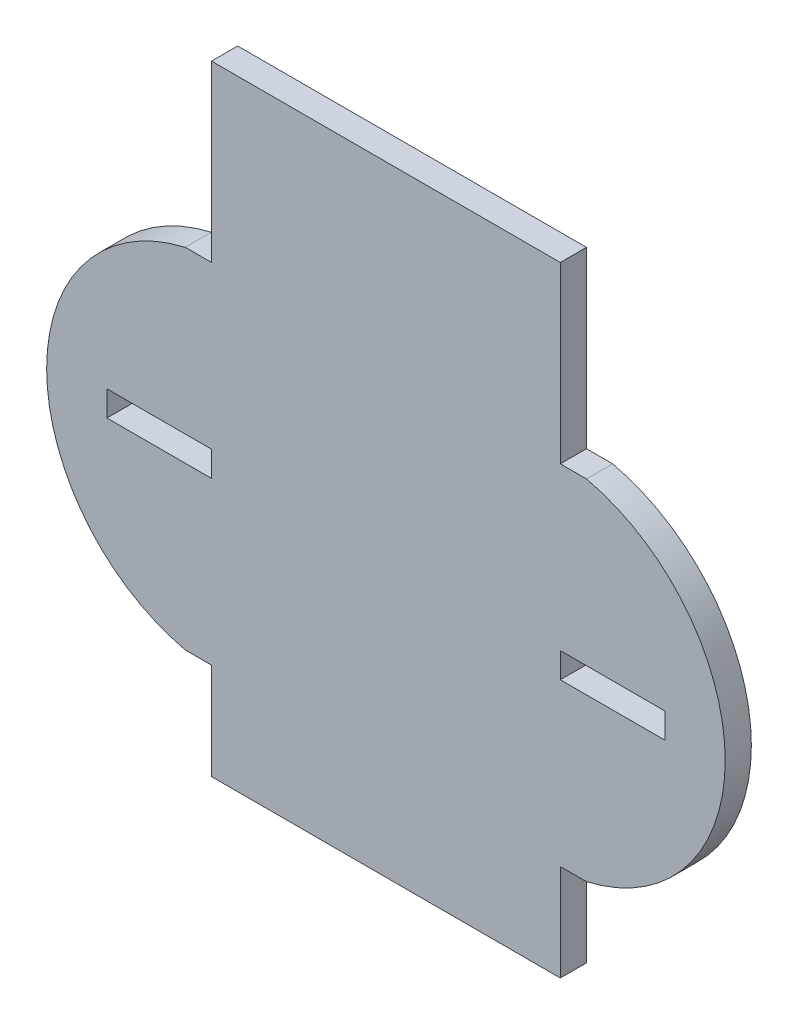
from build123d import *

# Parameters (mm, degrees)
ESQUISSE1_W        = 12
ESQUISSE1_H        = 2.9
BOSS_EXTRU_1_DEPTH = 3


with BuildPart() as part:
    # Esquisse1 → Boss.-Extru.1 (new body)
    with BuildSketch(Plane.XY):
        with BuildLine():
            Line((-20, -31.071211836), (-20, -20))
            Line((-20, -20), (-23, -20))
            ThreePointArc((-23, -20), (-38.912448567, 0), (-23, 20))
            Line((-23, 20), (-20, 20))
            Line((-20, 20), (-20, 40))
            Line((-20, 40), (20, 40))
            Line((20, 40), (20, 20))
            Line((20, 20), (23, 20))
            ThreePointArc((23, 20), (38.912448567, 0), (23, -20))
            Line((23, -20), (20, -20))
            Line((20, -20), (20, -31.071211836))
            Line((20, -31.071211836), (-20, -31.071211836))
        make_face()
        with Locations((26, 0)):
            Rectangle(ESQUISSE1_W, ESQUISSE1_H, mode=Mode.SUBTRACT)
        with Locations((-26, 0)):
            Rectangle(ESQUISSE1_W, ESQUISSE1_H, mode=Mode.SUBTRACT)
    extrude(amount=BOSS_EXTRU_1_DEPTH)


solid = part.part
